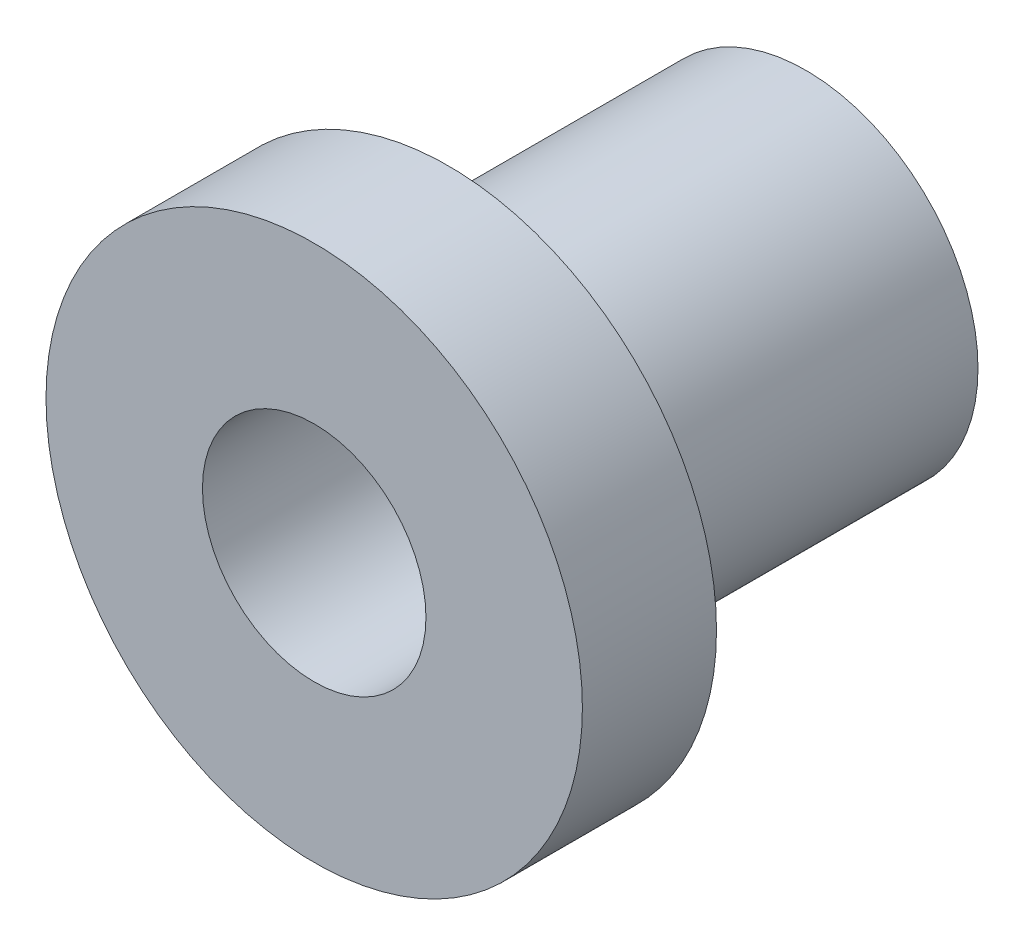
from build123d import *

# Parameters (mm, degrees)
ESQUISSE1_R             = 3.85
BOSS_EXTRU_1_DEPTH      = 8
ESQUISSE2_R             = 6
BOSS_EXTRU_2_DEPTH      = 3
ESQUISSE3_R             = 2.5
ENL_V_MAT_EXTRU_1_DEPTH = 12


with BuildPart() as part:
    # Esquisse1 → Boss.-Extru.1 (new body)
    with BuildSketch(Plane.XY):
        Circle(ESQUISSE1_R)
    extrude(amount=BOSS_EXTRU_1_DEPTH)

    # Esquisse2 → Boss.-Extru.2 (add)
    with BuildSketch(Plane.XY.offset(8)):
        Circle(ESQUISSE2_R)
    extrude(amount=BOSS_EXTRU_2_DEPTH)

    # Esquisse3 → Enl_v. mat.-Extru.1 (cut)
    with BuildSketch(Plane(origin=(0, 0, 0), x_dir=(-1, 0, 0), z_dir=(0, 0, -1))):
        Circle(ESQUISSE3_R)
    extrude(amount=-ENL_V_MAT_EXTRU_1_DEPTH, mode=Mode.SUBTRACT)


solid = part.part
